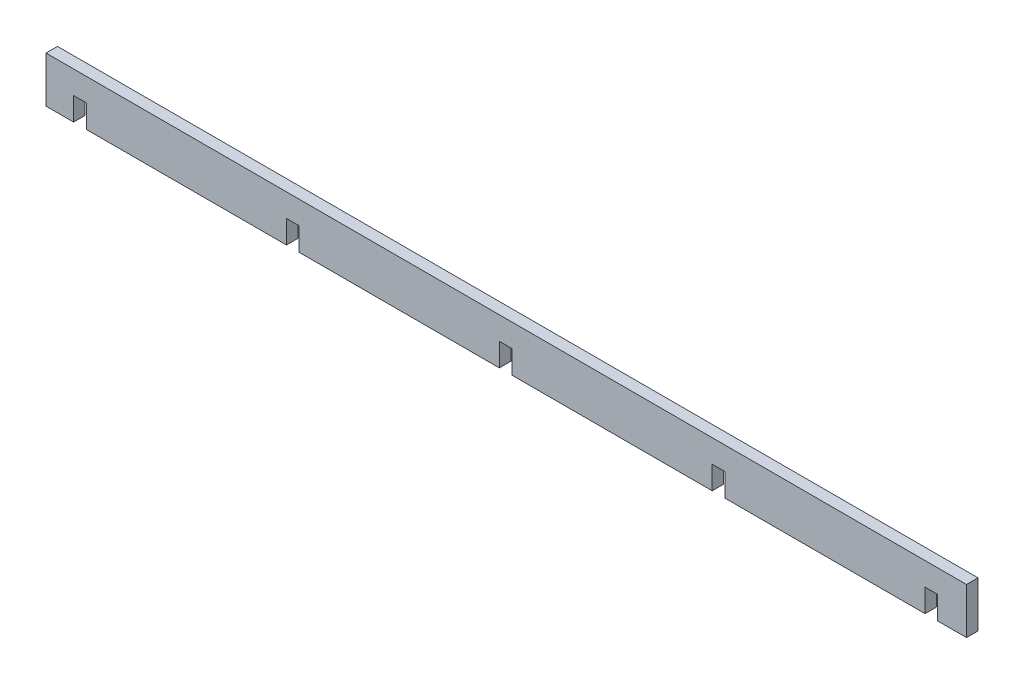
from build123d import *

# Parameters (mm, degrees)
ESQUISSE1_W                         = 1600
ESQUISSE1_H                         = 80
BOSS_EXTRU_1_DEPTH                  = 10
ENL_V_MAT_EXTRU_1_REACH             = 1604.03
ESQUISSE3_W                         = 22
ESQUISSE3_H                         = 40
ENL_V_MAT_EXTRU_1_DIRECTION_2_REACH = 1604.03


with BuildPart() as part:
    # Esquisse1 → Boss.-Extru.1 (new, symmetric)
    with BuildSketch(Plane.XY):
        with Locations((800, 40)):
            Rectangle(ESQUISSE1_W, ESQUISSE1_H)
    extrude(amount=BOSS_EXTRU_1_DEPTH, both=True)

    # Esquisse3 → Enl_v. mat.-Extru.1 (cut, up to next)
    with BuildSketch(Plane.XY, mode=Mode.PRIVATE) as enl_v_mat_extru_1_sk1:
        with Locations((59, 20)):
            Rectangle(ESQUISSE3_W, ESQUISSE3_H)
    enl_v_mat_extru_1_tool1 = extrude(enl_v_mat_extru_1_sk1.sketch, amount=-ENL_V_MAT_EXTRU_1_REACH, mode=Mode.PRIVATE) & part.part
    # Esquisse3 → Enl_v. mat.-Extru.1 (cut, up to next)
    with BuildSketch(Plane.XY, mode=Mode.PRIVATE) as enl_v_mat_extru_1_sk2:
        with Locations((429, 20)):
            Rectangle(ESQUISSE3_W, ESQUISSE3_H)
    enl_v_mat_extru_1_tool2 = extrude(enl_v_mat_extru_1_sk2.sketch, amount=-ENL_V_MAT_EXTRU_1_REACH, mode=Mode.PRIVATE) & part.part
    # Esquisse3 → Enl_v. mat.-Extru.1 (cut, up to next)
    with BuildSketch(Plane.XY, mode=Mode.PRIVATE) as enl_v_mat_extru_1_sk3:
        with Locations((799, 20)):
            Rectangle(ESQUISSE3_W, ESQUISSE3_H)
    enl_v_mat_extru_1_tool3 = extrude(enl_v_mat_extru_1_sk3.sketch, amount=-ENL_V_MAT_EXTRU_1_REACH, mode=Mode.PRIVATE) & part.part
    # Esquisse3 → Enl_v. mat.-Extru.1 (cut, up to next)
    with BuildSketch(Plane.XY, mode=Mode.PRIVATE) as enl_v_mat_extru_1_sk4:
        with Locations((1169, 20)):
            Rectangle(ESQUISSE3_W, ESQUISSE3_H)
    enl_v_mat_extru_1_tool4 = extrude(enl_v_mat_extru_1_sk4.sketch, amount=-ENL_V_MAT_EXTRU_1_REACH, mode=Mode.PRIVATE) & part.part
    # Esquisse3 → Enl_v. mat.-Extru.1 (cut, up to next)
    with BuildSketch(Plane.XY, mode=Mode.PRIVATE) as enl_v_mat_extru_1_sk5:
        with Locations((1539, 20)):
            Rectangle(ESQUISSE3_W, ESQUISSE3_H)
    enl_v_mat_extru_1_tool5 = extrude(enl_v_mat_extru_1_sk5.sketch, amount=-ENL_V_MAT_EXTRU_1_REACH, mode=Mode.PRIVATE) & part.part
    add(enl_v_mat_extru_1_tool1.solids().sort_by_distance((59, 20, 0))[0], mode=Mode.SUBTRACT)
    add(enl_v_mat_extru_1_tool2.solids().sort_by_distance((429, 20, 0))[0], mode=Mode.SUBTRACT)
    add(enl_v_mat_extru_1_tool3.solids().sort_by_distance((799, 20, 0))[0], mode=Mode.SUBTRACT)
    add(enl_v_mat_extru_1_tool4.solids().sort_by_distance((1169, 20, 0))[0], mode=Mode.SUBTRACT)
    add(enl_v_mat_extru_1_tool5.solids().sort_by_distance((1539, 20, 0))[0], mode=Mode.SUBTRACT)

    # Esquisse3 → Enl_v. mat.-Extru.1 direction 2 (cut, up to next)
    with BuildSketch(Plane.XY, mode=Mode.PRIVATE) as enl_v_mat_extru_1_direction_2_sk1:
        with Locations((59, 20)):
            Rectangle(ESQUISSE3_W, ESQUISSE3_H)
    enl_v_mat_extru_1_direction_2_tool1 = extrude(enl_v_mat_extru_1_direction_2_sk1.sketch, amount=ENL_V_MAT_EXTRU_1_DIRECTION_2_REACH, mode=Mode.PRIVATE) & part.part
    # Esquisse3 → Enl_v. mat.-Extru.1 direction 2 (cut, up to next)
    with BuildSketch(Plane.XY, mode=Mode.PRIVATE) as enl_v_mat_extru_1_direction_2_sk2:
        with Locations((429, 20)):
            Rectangle(ESQUISSE3_W, ESQUISSE3_H)
    enl_v_mat_extru_1_direction_2_tool2 = extrude(enl_v_mat_extru_1_direction_2_sk2.sketch, amount=ENL_V_MAT_EXTRU_1_DIRECTION_2_REACH, mode=Mode.PRIVATE) & part.part
    # Esquisse3 → Enl_v. mat.-Extru.1 direction 2 (cut, up to next)
    with BuildSketch(Plane.XY, mode=Mode.PRIVATE) as enl_v_mat_extru_1_direction_2_sk3:
        with Locations((799, 20)):
            Rectangle(ESQUISSE3_W, ESQUISSE3_H)
    enl_v_mat_extru_1_direction_2_tool3 = extrude(enl_v_mat_extru_1_direction_2_sk3.sketch, amount=ENL_V_MAT_EXTRU_1_DIRECTION_2_REACH, mode=Mode.PRIVATE) & part.part
    # Esquisse3 → Enl_v. mat.-Extru.1 direction 2 (cut, up to next)
    with BuildSketch(Plane.XY, mode=Mode.PRIVATE) as enl_v_mat_extru_1_direction_2_sk4:
        with Locations((1169, 20)):
            Rectangle(ESQUISSE3_W, ESQUISSE3_H)
    enl_v_mat_extru_1_direction_2_tool4 = extrude(enl_v_mat_extru_1_direction_2_sk4.sketch, amount=ENL_V_MAT_EXTRU_1_DIRECTION_2_REACH, mode=Mode.PRIVATE) & part.part
    # Esquisse3 → Enl_v. mat.-Extru.1 direction 2 (cut, up to next)
    with BuildSketch(Plane.XY, mode=Mode.PRIVATE) as enl_v_mat_extru_1_direction_2_sk5:
        with Locations((1539, 20)):
            Rectangle(ESQUISSE3_W, ESQUISSE3_H)
    enl_v_mat_extru_1_direction_2_tool5 = extrude(enl_v_mat_extru_1_direction_2_sk5.sketch, amount=ENL_V_MAT_EXTRU_1_DIRECTION_2_REACH, mode=Mode.PRIVATE) & part.part
    add(enl_v_mat_extru_1_direction_2_tool1.solids().sort_by_distance((59, 20, 0))[0], mode=Mode.SUBTRACT)
    add(enl_v_mat_extru_1_direction_2_tool2.solids().sort_by_distance((429, 20, 0))[0], mode=Mode.SUBTRACT)
    add(enl_v_mat_extru_1_direction_2_tool3.solids().sort_by_distance((799, 20, 0))[0], mode=Mode.SUBTRACT)
    add(enl_v_mat_extru_1_direction_2_tool4.solids().sort_by_distance((1169, 20, 0))[0], mode=Mode.SUBTRACT)
    add(enl_v_mat_extru_1_direction_2_tool5.solids().sort_by_distance((1539, 20, 0))[0], mode=Mode.SUBTRACT)


solid = part.part
